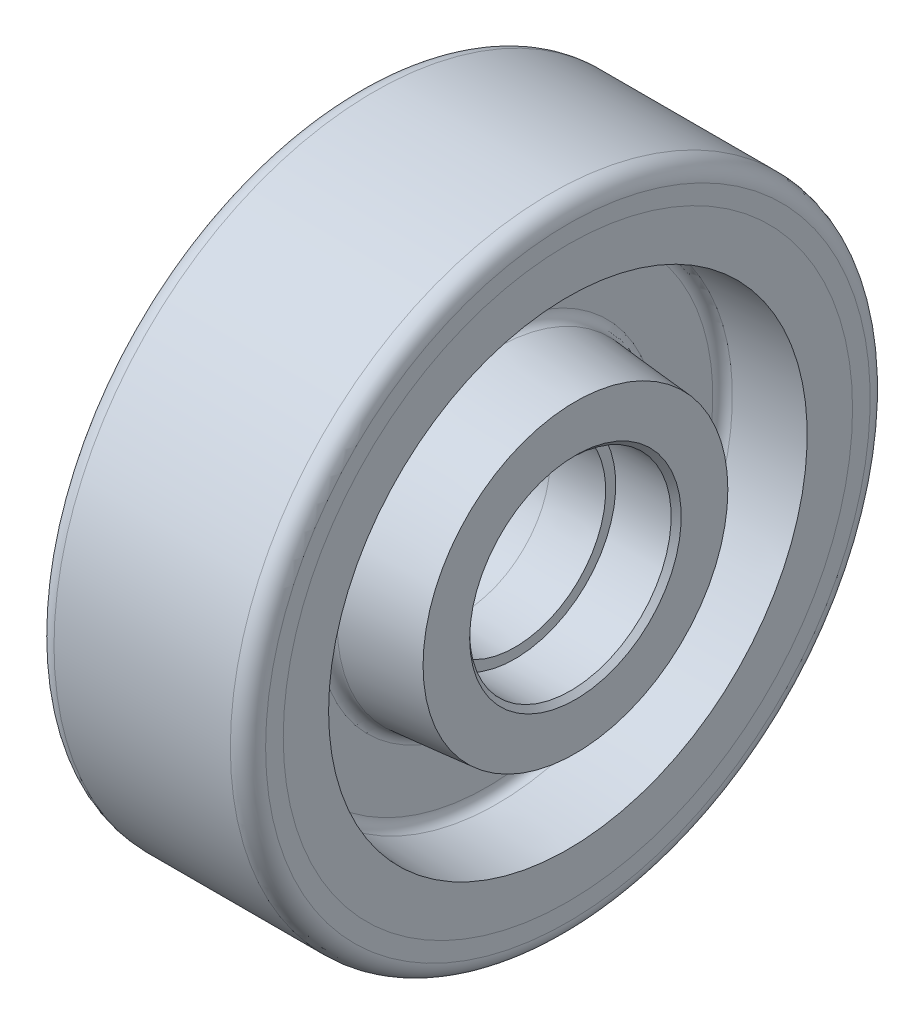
from build123d import *


with BuildPart() as part:
    # Sketch 1 → Revolve 1 (revolve)
    with BuildSketch(Plane(origin=(0, 0, 0), x_dir=(1, 0, 0), z_dir=(0, 1, 0)), mode=Mode.PRIVATE) as revolve_1_sk:
        with BuildLine():
            Line((22.5, 30.25), (6.825688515, 31.621324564))
            ThreePointArc((6.825688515, 31.621324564), (5.525445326, 32.262533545), (5, 33.61371396))
            Line((5, 33.61371396), (5, 44.763546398))
            ThreePointArc((5, 44.763546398), (5.549251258, 46.140255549), (6.895328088, 46.760805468))
            Line((6.895328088, 46.760805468), (21, 47.5))
            Line((21, 47.5), (21, 56.5))
            Line((21, 56.5), (0, 57.600563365))
            Line((0, 57.600563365), (-21, 56.5))
            Line((-21, 56.5), (-21, 47.5))
            Line((-21, 47.5), (-6.895328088, 46.760805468))
            ThreePointArc((-6.895328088, 46.760805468), (-5.549251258, 46.140255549), (-5, 44.763546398))
            Line((-5, 44.763546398), (-5, 33.61371396))
            ThreePointArc((-5, 33.61371396), (-5.525445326, 32.262533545), (-6.825688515, 31.621324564))
            Line((-6.825688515, 31.621324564), (-22.5, 30.25))
            Line((-22.5, 30.25), (-22.5, 21))
            Line((-22.5, 21), (-21.5, 20))
            Line((-21.5, 20), (-10.5, 20))
            Line((-10.5, 20), (-10.5, 18))
            Line((-10.5, 18), (0, 17.449718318))
            Line((0, 17.449718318), (10.5, 18))
            Line((10.5, 18), (10.5, 20))
            Line((10.5, 20), (21.5, 20))
            Line((21.5, 20), (22.5, 21))
            Line((22.5, 21), (22.5, 30.25))
        make_face()
    revolve(revolve_1_sk.sketch.rotate(Axis((-24.807246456, 0, 0), (1, 0, 0)), 180), axis=Axis((-24.807246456, 0, 0), (1, 0, 0)))


with BuildPart() as body_2:
    # Sketch 2 → Revolve 2 (revolve)
    with BuildSketch(Plane(origin=(0, 0, 0), x_dir=(1, 0, 0), z_dir=(0, 1, 0)), mode=Mode.PRIVATE) as revolve_2_sk:
        with BuildLine():
            Line((-17.5, 63.5), (17.5, 63.5))
            ThreePointArc((17.5, 63.5), (19.974873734, 62.474873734), (21, 60))
            Line((21, 60), (21, 56.5))
            Line((21, 56.5), (0, 57.600563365))
            Line((0, 57.600563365), (-21, 56.5))
            Line((-21, 56.5), (-21, 60))
            ThreePointArc((-21, 60), (-19.974873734, 62.474873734), (-17.5, 63.5))
        make_face()
    revolve(revolve_2_sk.sketch.rotate(Axis((-24.807246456, 0, 0), (1, 0, 0)), 180), axis=Axis((-24.807246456, 0, 0), (1, 0, 0)))


solid = Compound([part.part, body_2.part])
